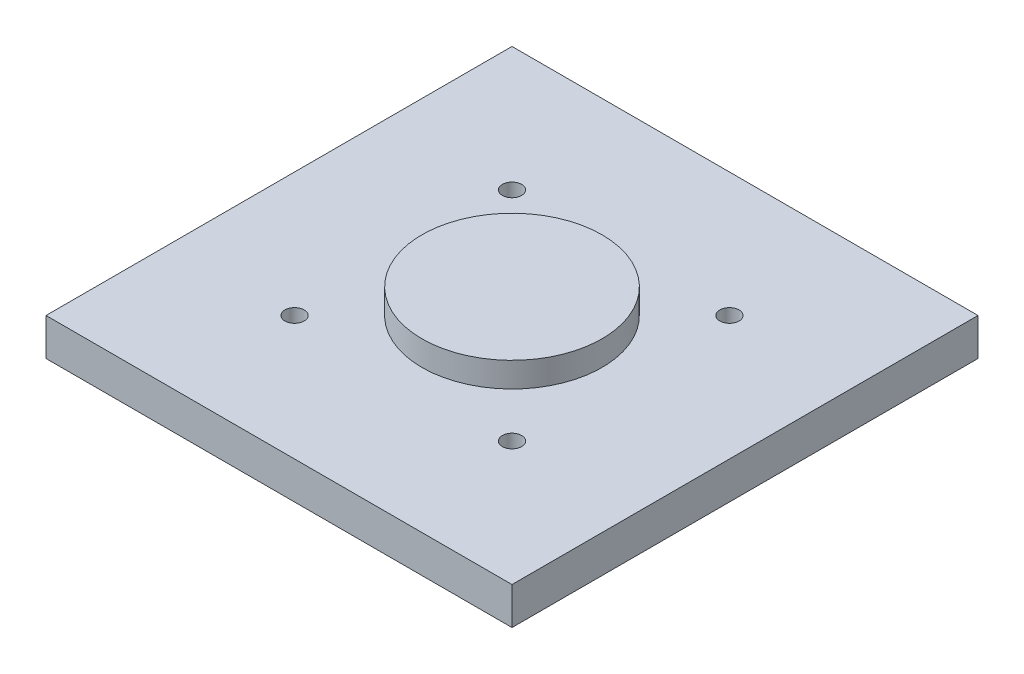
from build123d import *

# Parameters (mm, degrees)
ESQUISSE1_W        = 375
ESQUISSE1_H        = 30
BOSS_EXTRU_1_DEPTH = 375
D_GAGEMENT_M141_D  = 15.5
BOSS_EXTRU_2_DEPTH = 20


with BuildPart() as part:
    # Esquisse1 → Boss.-Extru.1 (new body)
    with BuildSketch(Plane.XY):
        with Locations((-154.807692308, -667.692307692)):
            Rectangle(ESQUISSE1_W, ESQUISSE1_H)
    extrude(amount=BOSS_EXTRU_1_DEPTH)

    # D_gagement M141 (through all)
    with Locations(Plane(origin=(0, -652.692307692, 0), x_dir=(1, 0, 0), z_dir=(0, 1, 0))):
        with Locations((-67.307692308, -100), (-242.307692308, -100), (-242.307692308, -275), (-67.307692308, -275)):
            Hole(D_GAGEMENT_M141_D / 2)

    # Esquisse15 → Boss.-Extru.2 (add)
    with BuildSketch(Plane(origin=(0, -652.692307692, 0), x_dir=(1, 0, 0), z_dir=(0, 1, 0))):
        with BuildLine():
            ThreePointArc((-82.307692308, -187.5), (-103.542450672, -136.234758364), (-154.807692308, -115))
            Line((-154.807692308, -115), (-154.807692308, -260))
            ThreePointArc((-154.807692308, -260), (-103.542450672, -238.765241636), (-82.307692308, -187.5))
        make_face()
        with BuildLine():
            Line((-154.807692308, -260), (-154.807692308, -115))
            ThreePointArc((-154.807692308, -115), (-227.307692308, -187.5), (-154.807692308, -260))
        make_face()
        with BuildLine():
            ThreePointArc((-82.307692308, -187.5), (-103.542450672, -136.234758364), (-154.807692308, -115))
            Line((-154.807692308, -115), (-154.807692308, -260))
            ThreePointArc((-154.807692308, -260), (-103.542450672, -238.765241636), (-82.307692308, -187.5))
        make_face()
        with BuildLine():
            Line((-154.807692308, -260), (-154.807692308, -115))
            ThreePointArc((-154.807692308, -115), (-227.307692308, -187.5), (-154.807692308, -260))
        make_face()
    extrude(amount=BOSS_EXTRU_2_DEPTH)


solid = part.part
